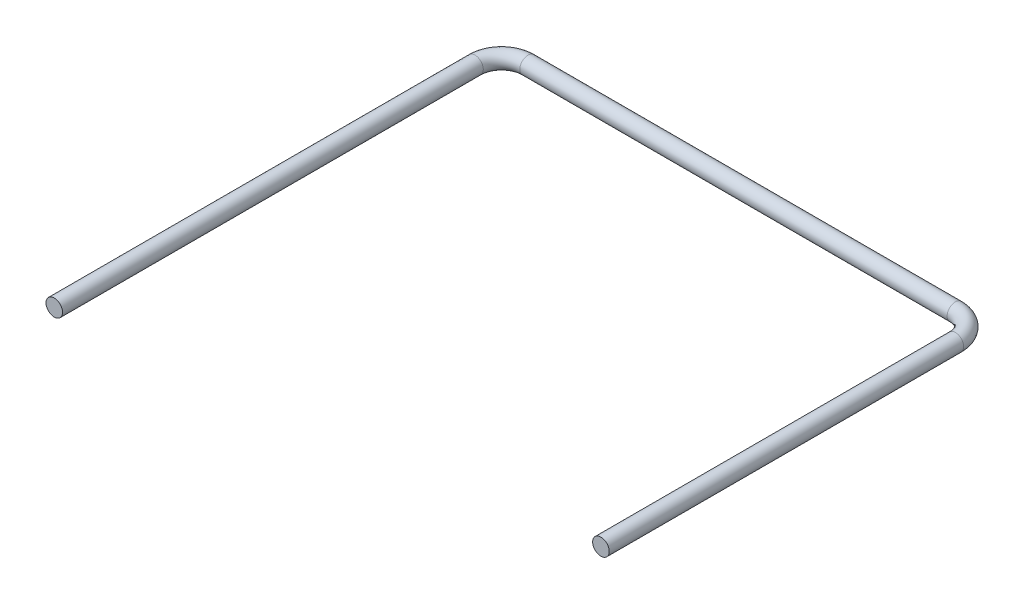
ISO-10303-21;
HEADER;
FILE_DESCRIPTION(('STEP AP214'),'2;1');
FILE_NAME('part.step','',(''),(''),'','','');
FILE_SCHEMA(('AUTOMOTIVE_DESIGN { 1 0 10303 214 1 1 1 1 }'));
ENDSEC;
DATA;
#1=APPLICATION_CONTEXT('core data for automotive mechanical design processes');
#2=APPLICATION_PROTOCOL_DEFINITION('international standard','automotive_design',2000,#1);
#3=PRODUCT_CONTEXT('',#1,'mechanical');
#4=PRODUCT('Part','Part','',(#3));
#5=PRODUCT_RELATED_PRODUCT_CATEGORY('part','',(#4));
#6=PRODUCT_DEFINITION_FORMATION('','',#4);
#7=PRODUCT_DEFINITION_CONTEXT('part definition',#1,'design');
#8=PRODUCT_DEFINITION('design','',#6,#7);
#9=PRODUCT_DEFINITION_SHAPE('','',#8);
#10=(LENGTH_UNIT() NAMED_UNIT(*) SI_UNIT(.MILLI.,.METRE.));
#11=(NAMED_UNIT(*) PLANE_ANGLE_UNIT() SI_UNIT($,.RADIAN.));
#12=(NAMED_UNIT(*) SI_UNIT($,.STERADIAN.) SOLID_ANGLE_UNIT());
#13=UNCERTAINTY_MEASURE_WITH_UNIT(LENGTH_MEASURE(1.E-05),#10,'distance_accuracy_value','');
#14=(GEOMETRIC_REPRESENTATION_CONTEXT(3) GLOBAL_UNCERTAINTY_ASSIGNED_CONTEXT((#13)) GLOBAL_UNIT_ASSIGNED_CONTEXT((#10,
#11,#12)) REPRESENTATION_CONTEXT('',''));
#15=CARTESIAN_POINT('',(0.,0.,0.));
#16=DIRECTION('',(0.,0.,1.));
#17=DIRECTION('',(1.,0.,0.));
#18=AXIS2_PLACEMENT_3D('',#15,#16,#17);
#19=CARTESIAN_POINT('',(3.68939443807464,0.,-37.4645087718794));
#20=DIRECTION('',(0.,0.,1.));
#21=DIRECTION('',(1.,0.,0.));
#22=AXIS2_PLACEMENT_3D('',#19,#20,#21);
#23=CYLINDRICAL_SURFACE('',#22,0.79375);
#24=CARTESIAN_POINT('',(3.68939443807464,0.,-37.4645087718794));
#25=DIRECTION('',(0.,0.,1.));
#26=DIRECTION('',(1.,0.,0.));
#27=AXIS2_PLACEMENT_3D('',#24,#25,#26);
#28=CIRCLE('',#27,0.79375);
#29=CARTESIAN_POINT('',(4.48314443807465,0.,-37.4645087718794));
#30=VERTEX_POINT('',#29);
#31=EDGE_CURVE('E35',#30,#30,#28,.T.);
#32=ORIENTED_EDGE('',*,*,#31,.T.);
#33=EDGE_LOOP('',(#32));
#34=FACE_BOUND('',#33,.T.);
#35=CARTESIAN_POINT('',(3.68939443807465,0.,-3.49200877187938));
#36=DIRECTION('',(0.,0.,1.));
#37=DIRECTION('',(1.,0.,0.));
#38=AXIS2_PLACEMENT_3D('',#35,#36,#37);
#39=CIRCLE('',#38,0.79375);
#40=CARTESIAN_POINT('',(4.48314443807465,0.,-3.49200877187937));
#41=VERTEX_POINT('',#40);
#42=EDGE_CURVE('E10',#41,#41,#39,.T.);
#43=ORIENTED_EDGE('',*,*,#42,.F.);
#44=EDGE_LOOP('',(#43));
#45=FACE_BOUND('',#44,.T.);
#46=ADVANCED_FACE('F29',(#34,#45),#23,.T.);
#47=CARTESIAN_POINT('',(1.14744999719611,0.,-37.4645087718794));
#48=DIRECTION('',(0.,-1.,0.));
#49=DIRECTION('',(0.,0.,-1.));
#50=AXIS2_PLACEMENT_3D('',#47,#48,#49);
#51=TOROIDAL_SURFACE('',#50,2.54194444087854,0.79375);
#52=CARTESIAN_POINT('',(1.14744999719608,0.,-40.0064532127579));
#53=DIRECTION('',(1.,0.,0.));
#54=DIRECTION('',(0.,0.,-1.));
#55=AXIS2_PLACEMENT_3D('',#52,#53,#54);
#56=CIRCLE('',#55,0.79375);
#57=CARTESIAN_POINT('',(1.14744999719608,0.,-40.8002032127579));
#58=VERTEX_POINT('',#57);
#59=EDGE_CURVE('E39',#58,#58,#56,.T.);
#60=CARTESIAN_POINT('',(1.14744999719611,0.,-37.4645087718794));
#61=DIRECTION('',(0.,-1.,0.));
#62=DIRECTION('',(0.,0.,-1.));
#63=AXIS2_PLACEMENT_3D('',#60,#61,#62);
#64=CIRCLE('',#63,3.33569444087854);
#65=EDGE_CURVE('',#58,#30,#64,.T.);
#66=ORIENTED_EDGE('',*,*,#59,.T.);
#67=ORIENTED_EDGE('',*,*,#31,.F.);
#68=ORIENTED_EDGE('',*,*,#65,.T.);
#69=ORIENTED_EDGE('',*,*,#65,.F.);
#70=EDGE_LOOP('',(#66,#68,#67,#69));
#71=FACE_BOUND('',#70,.T.);
#72=ADVANCED_FACE('F73',(#71),#51,.T.);
#73=CARTESIAN_POINT('',(-39.8100500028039,0.,-40.0064532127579));
#74=DIRECTION('',(1.,0.,0.));
#75=DIRECTION('',(0.,0.,-1.));
#76=AXIS2_PLACEMENT_3D('',#73,#74,#75);
#77=CYLINDRICAL_SURFACE('',#76,0.79375);
#78=CARTESIAN_POINT('',(-39.8100500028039,0.,-40.0064532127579));
#79=DIRECTION('',(1.,0.,0.));
#80=DIRECTION('',(0.,0.,-1.));
#81=AXIS2_PLACEMENT_3D('',#78,#79,#80);
#82=CIRCLE('',#81,0.79375);
#83=CARTESIAN_POINT('',(-39.8100500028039,0.,-40.8002032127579));
#84=VERTEX_POINT('',#83);
#85=EDGE_CURVE('E43',#84,#84,#82,.T.);
#86=ORIENTED_EDGE('',*,*,#85,.T.);
#87=EDGE_LOOP('',(#86));
#88=FACE_BOUND('',#87,.T.);
#89=ORIENTED_EDGE('',*,*,#59,.F.);
#90=EDGE_LOOP('',(#89));
#91=FACE_BOUND('',#90,.T.);
#92=ADVANCED_FACE('F77',(#88,#91),#77,.T.);
#93=CARTESIAN_POINT('',(-39.8100500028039,0.,-37.4645087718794));
#94=DIRECTION('',(0.,-1.,0.));
#95=DIRECTION('',(0.,0.,-1.));
#96=AXIS2_PLACEMENT_3D('',#93,#94,#95);
#97=TOROIDAL_SURFACE('',#96,2.54194444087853,0.79375);
#98=CARTESIAN_POINT('',(-42.3519944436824,0.,-37.4645087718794));
#99=DIRECTION('',(0.,0.,-1.));
#100=DIRECTION('',(-1.,0.,0.));
#101=AXIS2_PLACEMENT_3D('',#98,#99,#100);
#102=CIRCLE('',#101,0.79375);
#103=CARTESIAN_POINT('',(-43.1457444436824,0.,-37.4645087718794));
#104=VERTEX_POINT('',#103);
#105=EDGE_CURVE('E48',#104,#104,#102,.T.);
#106=CARTESIAN_POINT('',(-39.8100500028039,0.,-37.4645087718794));
#107=DIRECTION('',(0.,-1.,0.));
#108=DIRECTION('',(0.,0.,-1.));
#109=AXIS2_PLACEMENT_3D('',#106,#107,#108);
#110=CIRCLE('',#109,3.33569444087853);
#111=EDGE_CURVE('',#104,#84,#110,.T.);
#112=ORIENTED_EDGE('',*,*,#105,.T.);
#113=ORIENTED_EDGE('',*,*,#85,.F.);
#114=ORIENTED_EDGE('',*,*,#111,.T.);
#115=ORIENTED_EDGE('',*,*,#111,.F.);
#116=EDGE_LOOP('',(#112,#114,#113,#115));
#117=FACE_BOUND('',#116,.T.);
#118=ADVANCED_FACE('F55',(#117),#97,.T.);
#119=CARTESIAN_POINT('',(-42.3519944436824,0.,-37.4645087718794));
#120=DIRECTION('',(0.,0.,1.));
#121=DIRECTION('',(1.,0.,0.));
#122=AXIS2_PLACEMENT_3D('',#119,#120,#121);
#123=CYLINDRICAL_SURFACE('',#122,0.79375);
#124=ORIENTED_EDGE('',*,*,#105,.F.);
#125=EDGE_LOOP('',(#124));
#126=FACE_BOUND('',#125,.T.);
#127=CARTESIAN_POINT('',(-42.3519944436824,0.,2.85799122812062));
#128=DIRECTION('',(0.,0.,-1.));
#129=DIRECTION('',(-1.,0.,0.));
#130=AXIS2_PLACEMENT_3D('',#127,#128,#129);
#131=CIRCLE('',#130,0.79375);
#132=CARTESIAN_POINT('',(-43.1457444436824,0.,2.85799122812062));
#133=VERTEX_POINT('',#132);
#134=EDGE_CURVE('E49',#133,#133,#131,.T.);
#135=ORIENTED_EDGE('',*,*,#134,.T.);
#136=EDGE_LOOP('',(#135));
#137=FACE_BOUND('',#136,.T.);
#138=ADVANCED_FACE('F58',(#126,#137),#123,.T.);
#139=CARTESIAN_POINT('',(3.68939443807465,0.,-3.49200877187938));
#140=DIRECTION('',(0.,0.,1.));
#141=DIRECTION('',(1.,0.,0.));
#142=AXIS2_PLACEMENT_3D('',#139,#140,#141);
#143=PLANE('',#142);
#144=ORIENTED_EDGE('',*,*,#42,.T.);
#145=EDGE_LOOP('',(#144));
#146=FACE_BOUND('',#145,.T.);
#147=ADVANCED_FACE('F61',(#146),#143,.T.);
#148=CARTESIAN_POINT('',(-42.3519944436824,0.,2.85799122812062));
#149=DIRECTION('',(0.,0.,-1.));
#150=DIRECTION('',(-1.,0.,0.));
#151=AXIS2_PLACEMENT_3D('',#148,#149,#150);
#152=PLANE('',#151);
#153=ORIENTED_EDGE('',*,*,#134,.F.);
#154=EDGE_LOOP('',(#153));
#155=FACE_BOUND('',#154,.T.);
#156=ADVANCED_FACE('F65',(#155),#152,.F.);
#157=CLOSED_SHELL('',(#46,#72,#92,#118,#138,#147,#156));
#158=MANIFOLD_SOLID_BREP('B2',#157);
#159=ADVANCED_BREP_SHAPE_REPRESENTATION('',(#18,#158),#14);
#160=SHAPE_DEFINITION_REPRESENTATION(#9,#159);
ENDSEC;
END-ISO-10303-21;
